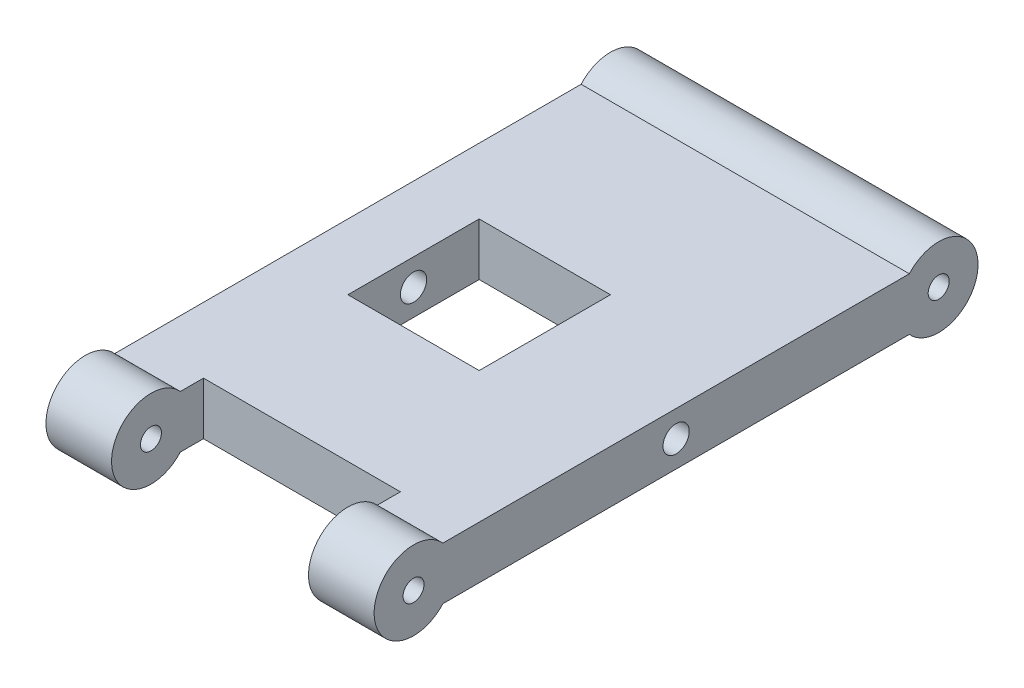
from build123d import *

# Parameters (mm, degrees)
SKETCH1_W           = 50.8
SKETCH1_H           = 5.08
BOSS_EXTRUDE1_DEPTH = 31.75
SKETCH2_R           = 3.81
BOSS_EXTRUDE2_DEPTH = 31.75
SKETCH3_W           = 19.05
SKETCH3_H           = 13.711267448
CUT_EXTRUDE1_DEPTH  = 15.875
SKETCH4_W           = 12.7
SKETCH4_H           = 12.7
CUT_EXTRUDE2_DEPTH  = 64.48729873
SKETCH5_R           = 1.27
CUT_EXTRUDE3_DEPTH  = 64.48729873
SKETCH6_R           = 1.016
CUT_EXTRUDE4_DEPTH  = 64.48729873


with BuildPart() as part:
    # Sketch1 → Boss-Extrude1 (new body)
    with BuildSketch(Plane(origin=(0, 0, 0), x_dir=(0, 0, -1), z_dir=(1, 0, 0))):
        with Locations((25.4, 2.54)):
            Rectangle(SKETCH1_W, SKETCH1_H)
    extrude(amount=BOSS_EXTRUDE1_DEPTH)

    # Sketch2 → Boss-Extrude2 (add)
    with BuildSketch(Plane(origin=(31.75, 0, 0), x_dir=(0, 0, -1), z_dir=(1, 0, 0))):
        with Locations((0, 2.54)):
            Circle(SKETCH2_R)
        with Locations((50.8, 2.54)):
            Circle(SKETCH2_R)
    extrude(amount=-BOSS_EXTRUDE2_DEPTH)

    # Sketch3 → Cut-Extrude1 (cut, symmetric)
    with BuildSketch(Plane(origin=(0, 5.08, 0), x_dir=(1, 0, 0), z_dir=(0, 1, 0))):
        with Locations((15.875, -1.775633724)):
            Rectangle(SKETCH3_W, SKETCH3_H)
    extrude(amount=CUT_EXTRUDE1_DEPTH, both=True, mode=Mode.SUBTRACT)

    # Sketch4 → Cut-Extrude2 (cut, through all)
    with BuildSketch(Plane(origin=(0, 5.08, 0), x_dir=(1, 0, 0), z_dir=(0, 1, 0))):
        with Locations((12.7, 25.4)):
            Rectangle(SKETCH4_W, SKETCH4_H)
    extrude(amount=-CUT_EXTRUDE2_DEPTH, mode=Mode.SUBTRACT)

    # Sketch5 → Cut-Extrude3 (cut, through all)
    with BuildSketch(Plane.ZY):
        with Locations((-25.4, 2.54)):
            Circle(SKETCH5_R)
    extrude(amount=-CUT_EXTRUDE3_DEPTH, mode=Mode.SUBTRACT)

    # Sketch6 → Cut-Extrude4 (cut, through all)
    with BuildSketch(Plane.ZY):
        with Locations((-50.8, 2.54)):
            Circle(SKETCH6_R)
        with Locations((0, 2.54)):
            Circle(SKETCH6_R)
    extrude(amount=-CUT_EXTRUDE4_DEPTH, mode=Mode.SUBTRACT)


solid = part.part
